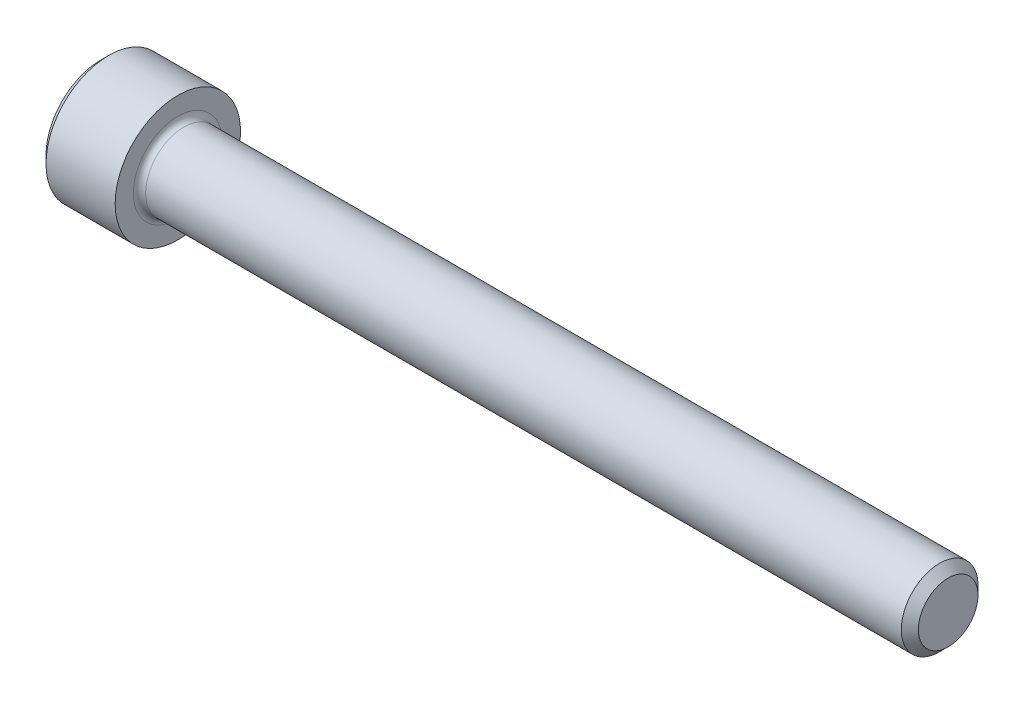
from build123d import *

# Parameters (mm, degrees)
FILLET1_R   = 0.2286
HEX_2_DEPTH = 1.2954


with BuildPart() as part:
    # BodySke → Base-Revolve (revolve)
    with BuildSketch(Plane.XY, mode=Mode.PRIVATE) as base_revolve_sk:
        Polygon((0, 0), (0, 2.0447), (0.2794, 2.3241), (2.8448, 2.3241), (2.8448, 1.4224), (31.10357, 1.4224), (31.4198, 1.10617), (31.4198, 0), align=None)
    revolve(base_revolve_sk.sketch.rotate(Axis((-31.75, 0, 0), (1, 0, 0)), 90), axis=Axis((-31.75, 0, 0), (1, 0, 0)))

    # Fillet1
    fillet1_edges = [part.edges().sort_by_distance(p)[0] for p in [
        (2.8448, 0, -1.4224),
    ]]
    fillet(fillet1_edges, radius=FILLET1_R)

    # Sketch2 → Hex-PreBroach (revolve, cut)
    with BuildSketch(Plane.XY, mode=Mode.PRIVATE) as hex_prebroach_sk:
        Polygon((0, 1.1938), (1.2954, 1.1938), (1.984640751, 0), (0, 0), align=None)
    revolve(hex_prebroach_sk.sketch.rotate(Axis((0, 0, 0), (1, 0, 0)), 90), axis=Axis((0, 0, 0), (1, 0, 0)), mode=Mode.SUBTRACT)

    # Sketch3 → Hex 2 (cut)
    with BuildSketch(Plane(origin=(0, 0, 0), x_dir=(0, 0.500000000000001, 0.866025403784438), z_dir=(-1, 0, 0))):
        Polygon((0.689240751, 1.1938), (-0.689240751, 1.1938), (-1.378481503, 0), (-0.689240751, -1.1938), (0.689240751, -1.1938), (1.378481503, 0), align=None)
    extrude(amount=-HEX_2_DEPTH, mode=Mode.SUBTRACT)


solid = part.part
